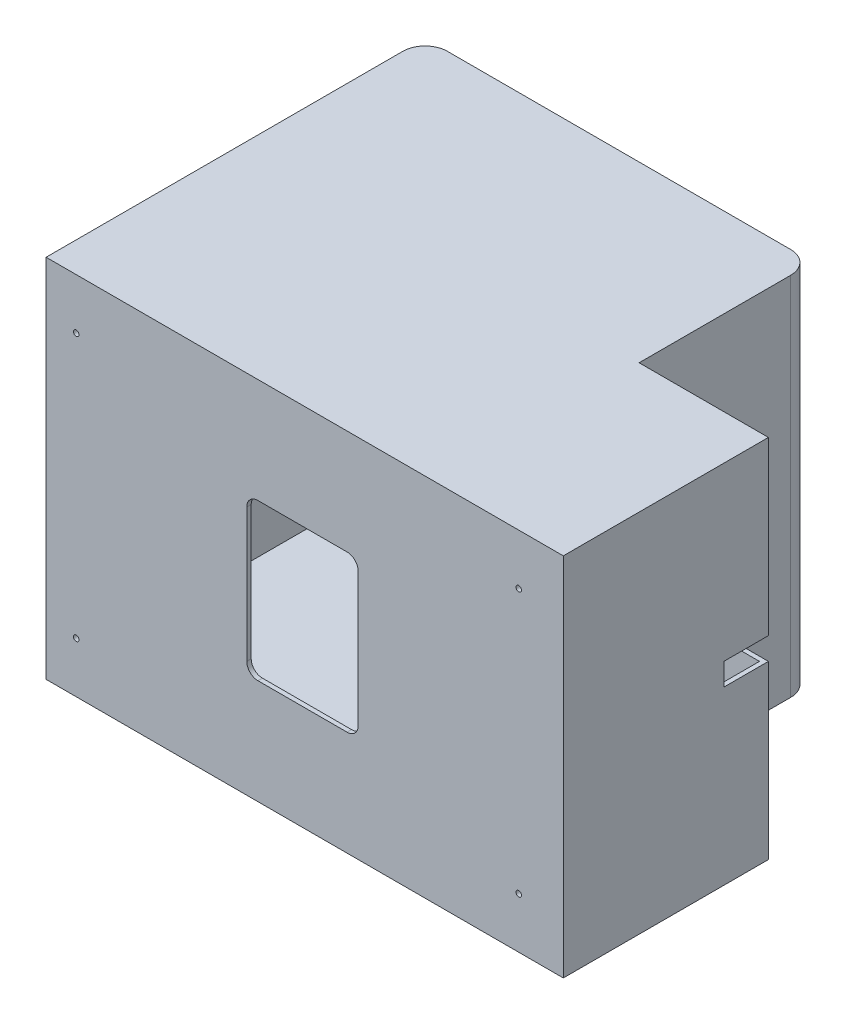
ISO-10303-21;
HEADER;
FILE_DESCRIPTION(('STEP AP214'),'2;1');
FILE_NAME('part.step','',(''),(''),'','','');
FILE_SCHEMA(('AUTOMOTIVE_DESIGN { 1 0 10303 214 1 1 1 1 }'));
ENDSEC;
DATA;
#1=APPLICATION_CONTEXT('core data for automotive mechanical design processes');
#2=APPLICATION_PROTOCOL_DEFINITION('international standard','automotive_design',2000,#1);
#3=PRODUCT_CONTEXT('',#1,'mechanical');
#4=PRODUCT('Part','Part','',(#3));
#5=PRODUCT_RELATED_PRODUCT_CATEGORY('part','',(#4));
#6=PRODUCT_DEFINITION_FORMATION('','',#4);
#7=PRODUCT_DEFINITION_CONTEXT('part definition',#1,'design');
#8=PRODUCT_DEFINITION('design','',#6,#7);
#9=PRODUCT_DEFINITION_SHAPE('','',#8);
#10=(LENGTH_UNIT() NAMED_UNIT(*) SI_UNIT(.MILLI.,.METRE.));
#11=(NAMED_UNIT(*) PLANE_ANGLE_UNIT() SI_UNIT($,.RADIAN.));
#12=(NAMED_UNIT(*) SI_UNIT($,.STERADIAN.) SOLID_ANGLE_UNIT());
#13=UNCERTAINTY_MEASURE_WITH_UNIT(LENGTH_MEASURE(1.E-05),#10,'distance_accuracy_value','');
#14=(GEOMETRIC_REPRESENTATION_CONTEXT(3) GLOBAL_UNCERTAINTY_ASSIGNED_CONTEXT((#13)) GLOBAL_UNIT_ASSIGNED_CONTEXT((#10,
#11,#12)) REPRESENTATION_CONTEXT('',''));
#15=CARTESIAN_POINT('',(0.,0.,0.));
#16=DIRECTION('',(0.,0.,1.));
#17=DIRECTION('',(1.,0.,0.));
#18=AXIS2_PLACEMENT_3D('',#15,#16,#17);
#19=CARTESIAN_POINT('',(189.603938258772,164.,-77.9102908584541));
#20=DIRECTION('',(0.,0.,1.));
#21=DIRECTION('',(1.,0.,0.));
#22=AXIS2_PLACEMENT_3D('',#19,#20,#21);
#23=PLANE('',#22);
#24=DIRECTION('',(0.,-1.,0.));
#25=VECTOR('',#24,1.);
#26=CARTESIAN_POINT('',(131.603938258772,164.,-77.9102908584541));
#27=LINE('',#26,#25);
#28=CARTESIAN_POINT('',(131.603938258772,77.,-77.9102908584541));
#29=VERTEX_POINT('',#28);
#30=CARTESIAN_POINT('',(131.603938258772,0.,-77.9102908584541));
#31=VERTEX_POINT('',#30);
#32=EDGE_CURVE('E422',#29,#31,#27,.T.);
#33=ORIENTED_EDGE('',*,*,#32,.F.);
#34=DIRECTION('',(1.,0.,0.));
#35=VECTOR('',#34,1.);
#36=CARTESIAN_POINT('',(96.6039382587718,77.,-77.9102908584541));
#37=LINE('',#36,#35);
#38=CARTESIAN_POINT('',(189.603938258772,77.,-77.9102908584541));
#39=VERTEX_POINT('',#38);
#40=EDGE_CURVE('E468',#29,#39,#37,.T.);
#41=ORIENTED_EDGE('',*,*,#40,.T.);
#42=DIRECTION('',(0.,-1.,0.));
#43=VECTOR('',#42,1.);
#44=CARTESIAN_POINT('',(189.603938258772,164.,-77.9102908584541));
#45=LINE('',#44,#43);
#46=CARTESIAN_POINT('',(189.603938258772,0.,-77.9102908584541));
#47=VERTEX_POINT('',#46);
#48=EDGE_CURVE('E271',#39,#47,#45,.T.);
#49=ORIENTED_EDGE('',*,*,#48,.T.);
#50=DIRECTION('',(-1.,0.,0.));
#51=VECTOR('',#50,1.);
#52=CARTESIAN_POINT('',(189.603938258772,0.,-77.9102908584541));
#53=LINE('',#52,#51);
#54=EDGE_CURVE('E431',#47,#31,#53,.T.);
#55=ORIENTED_EDGE('',*,*,#54,.T.);
#56=EDGE_LOOP('',(#33,#41,#49,#55));
#57=FACE_BOUND('',#56,.T.);
#58=ADVANCED_FACE('F16',(#57),#23,.F.);
#59=CARTESIAN_POINT('',(189.603938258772,164.,-75.9102908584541));
#60=DIRECTION('',(0.,0.,1.));
#61=DIRECTION('',(1.,0.,0.));
#62=AXIS2_PLACEMENT_3D('',#59,#60,#61);
#63=PLANE('',#62);
#64=DIRECTION('',(1.,0.,0.));
#65=VECTOR('',#64,1.);
#66=CARTESIAN_POINT('',(189.603938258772,77.,-75.9102908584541));
#67=LINE('',#66,#65);
#68=CARTESIAN_POINT('',(129.603938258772,77.,-75.9102908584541));
#69=VERTEX_POINT('',#68);
#70=CARTESIAN_POINT('',(187.603938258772,77.,-75.9102908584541));
#71=VERTEX_POINT('',#70);
#72=EDGE_CURVE('E25',#69,#71,#67,.T.);
#73=ORIENTED_EDGE('',*,*,#72,.F.);
#74=DIRECTION('',(0.,-1.,0.));
#75=VECTOR('',#74,1.);
#76=CARTESIAN_POINT('',(129.603938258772,164.,-75.9102908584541));
#77=LINE('',#76,#75);
#78=CARTESIAN_POINT('',(129.603938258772,2.,-75.9102908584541));
#79=VERTEX_POINT('',#78);
#80=EDGE_CURVE('E385',#69,#79,#77,.T.);
#81=ORIENTED_EDGE('',*,*,#80,.T.);
#82=DIRECTION('',(-1.,0.,0.));
#83=VECTOR('',#82,1.);
#84=CARTESIAN_POINT('',(0.,2.,-75.9102908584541));
#85=LINE('',#84,#83);
#86=CARTESIAN_POINT('',(187.603938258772,2.,-75.9102908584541));
#87=VERTEX_POINT('',#86);
#88=EDGE_CURVE('E378',#87,#79,#85,.T.);
#89=ORIENTED_EDGE('',*,*,#88,.F.);
#90=DIRECTION('',(0.,-1.,0.));
#91=VECTOR('',#90,1.);
#92=CARTESIAN_POINT('',(187.603938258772,164.,-75.9102908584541));
#93=LINE('',#92,#91);
#94=EDGE_CURVE('E371',#71,#87,#93,.T.);
#95=ORIENTED_EDGE('',*,*,#94,.F.);
#96=EDGE_LOOP('',(#73,#81,#89,#95));
#97=FACE_BOUND('',#96,.T.);
#98=ADVANCED_FACE('F376',(#97),#63,.T.);
#99=CARTESIAN_POINT('',(129.603938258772,164.,-155.910290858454));
#100=DIRECTION('',(-1.,0.,0.));
#101=DIRECTION('',(0.,0.,1.));
#102=AXIS2_PLACEMENT_3D('',#99,#100,#101);
#103=PLANE('',#102);
#104=DIRECTION('',(0.,0.,1.));
#105=VECTOR('',#104,1.);
#106=CARTESIAN_POINT('',(129.603938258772,77.,-155.910290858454));
#107=LINE('',#106,#105);
#108=CARTESIAN_POINT('',(129.603938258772,77.,-77.9102908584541));
#109=VERTEX_POINT('',#108);
#110=EDGE_CURVE('E363',#109,#69,#107,.T.);
#111=ORIENTED_EDGE('',*,*,#110,.F.);
#112=DIRECTION('',(0.,-1.,0.));
#113=VECTOR('',#112,1.);
#114=CARTESIAN_POINT('',(129.603938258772,164.,-77.9102908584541));
#115=LINE('',#114,#113);
#116=CARTESIAN_POINT('',(129.603938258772,87.,-77.9102908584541));
#117=VERTEX_POINT('',#116);
#118=EDGE_CURVE('E480',#117,#109,#115,.T.);
#119=ORIENTED_EDGE('',*,*,#118,.F.);
#120=DIRECTION('',(0.,0.,-1.));
#121=VECTOR('',#120,1.);
#122=CARTESIAN_POINT('',(129.603938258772,87.,-155.910290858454));
#123=LINE('',#122,#121);
#124=CARTESIAN_POINT('',(129.603938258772,87.,-75.9102908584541));
#125=VERTEX_POINT('',#124);
#126=EDGE_CURVE('E373',#125,#117,#123,.T.);
#127=ORIENTED_EDGE('',*,*,#126,.F.);
#128=CARTESIAN_POINT('',(129.603938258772,162.,-75.9102908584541));
#129=VERTEX_POINT('',#128);
#130=EDGE_CURVE('E380',#129,#125,#77,.T.);
#131=ORIENTED_EDGE('',*,*,#130,.F.);
#132=DIRECTION('',(0.,0.,-1.));
#133=VECTOR('',#132,1.);
#134=CARTESIAN_POINT('',(129.603938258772,162.,0.));
#135=LINE('',#134,#133);
#136=CARTESIAN_POINT('',(129.603938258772,162.,-143.910290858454));
#137=VERTEX_POINT('',#136);
#138=EDGE_CURVE('E398',#129,#137,#135,.T.);
#139=ORIENTED_EDGE('',*,*,#138,.T.);
#140=DIRECTION('',(0.,-1.,0.));
#141=VECTOR('',#140,1.);
#142=CARTESIAN_POINT('',(129.603938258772,164.,-143.910290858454));
#143=LINE('',#142,#141);
#144=CARTESIAN_POINT('',(129.603938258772,2.,-143.910290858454));
#145=VERTEX_POINT('',#144);
#146=EDGE_CURVE('E349',#137,#145,#143,.T.);
#147=ORIENTED_EDGE('',*,*,#146,.T.);
#148=DIRECTION('',(0.,0.,-1.));
#149=VECTOR('',#148,1.);
#150=CARTESIAN_POINT('',(129.603938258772,2.,0.));
#151=LINE('',#150,#149);
#152=EDGE_CURVE('E395',#79,#145,#151,.T.);
#153=ORIENTED_EDGE('',*,*,#152,.F.);
#154=ORIENTED_EDGE('',*,*,#80,.F.);
#155=EDGE_LOOP('',(#111,#119,#127,#131,#139,#147,#153,#154));
#156=FACE_BOUND('',#155,.T.);
#157=ADVANCED_FACE('F566',(#156),#103,.T.);
#158=CARTESIAN_POINT('',(-42.3960617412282,164.,-155.910290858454));
#159=DIRECTION('',(0.,0.,1.));
#160=DIRECTION('',(1.,0.,0.));
#161=AXIS2_PLACEMENT_3D('',#158,#159,#160);
#162=PLANE('',#161);
#163=DIRECTION('',(0.,1.,0.));
#164=VECTOR('',#163,1.);
#165=CARTESIAN_POINT('',(101.603938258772,162.,-155.910290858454));
#166=LINE('',#165,#164);
#167=CARTESIAN_POINT('',(101.603938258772,2.,-155.910290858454));
#168=VERTEX_POINT('',#167);
#169=CARTESIAN_POINT('',(101.603938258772,162.,-155.910290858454));
#170=VERTEX_POINT('',#169);
#171=EDGE_CURVE('E482',#168,#170,#166,.T.);
#172=ORIENTED_EDGE('',*,*,#171,.T.);
#173=DIRECTION('',(-1.,0.,0.));
#174=VECTOR('',#173,1.);
#175=CARTESIAN_POINT('',(0.,162.,-155.910290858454));
#176=LINE('',#175,#174);
#177=CARTESIAN_POINT('',(2.10393825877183,162.,-155.910290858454));
#178=VERTEX_POINT('',#177);
#179=EDGE_CURVE('E404',#170,#178,#176,.T.);
#180=ORIENTED_EDGE('',*,*,#179,.T.);
#181=DIRECTION('',(0.,-1.,0.));
#182=VECTOR('',#181,1.);
#183=CARTESIAN_POINT('',(2.10393825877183,162.,-155.910290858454));
#184=LINE('',#183,#182);
#185=CARTESIAN_POINT('',(2.10393825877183,2.,-155.910290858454));
#186=VERTEX_POINT('',#185);
#187=EDGE_CURVE('E497',#178,#186,#184,.T.);
#188=ORIENTED_EDGE('',*,*,#187,.T.);
#189=DIRECTION('',(-1.,0.,0.));
#190=VECTOR('',#189,1.);
#191=CARTESIAN_POINT('',(0.,2.,-155.910290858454));
#192=LINE('',#191,#190);
#193=EDGE_CURVE('E401',#168,#186,#192,.T.);
#194=ORIENTED_EDGE('',*,*,#193,.F.);
#195=EDGE_LOOP('',(#172,#180,#188,#194));
#196=FACE_BOUND('',#195,.T.);
#197=DIRECTION('',(-1.,0.,0.));
#198=VECTOR('',#197,1.);
#199=CARTESIAN_POINT('',(-42.3960617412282,0.,-155.910290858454));
#200=LINE('',#199,#198);
#201=CARTESIAN_POINT('',(121.603938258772,0.,-155.910290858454));
#202=VERTEX_POINT('',#201);
#203=CARTESIAN_POINT('',(-32.3960617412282,0.,-155.910290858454));
#204=VERTEX_POINT('',#203);
#205=EDGE_CURVE('E411',#202,#204,#200,.T.);
#206=ORIENTED_EDGE('',*,*,#205,.T.);
#207=DIRECTION('',(0.,-1.,0.));
#208=VECTOR('',#207,1.);
#209=CARTESIAN_POINT('',(-32.3960617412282,164.,-155.910290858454));
#210=LINE('',#209,#208);
#211=CARTESIAN_POINT('',(-32.3960617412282,164.,-155.910290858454));
#212=VERTEX_POINT('',#211);
#213=EDGE_CURVE('E328',#204,#212,#210,.F.);
#214=ORIENTED_EDGE('',*,*,#213,.T.);
#215=DIRECTION('',(-1.,0.,0.));
#216=VECTOR('',#215,1.);
#217=CARTESIAN_POINT('',(-42.3960617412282,164.,-155.910290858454));
#218=LINE('',#217,#216);
#219=CARTESIAN_POINT('',(121.603938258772,164.,-155.910290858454));
#220=VERTEX_POINT('',#219);
#221=EDGE_CURVE('E419',#220,#212,#218,.T.);
#222=ORIENTED_EDGE('',*,*,#221,.F.);
#223=DIRECTION('',(0.,-1.,0.));
#224=VECTOR('',#223,1.);
#225=CARTESIAN_POINT('',(121.603938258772,164.,-155.910290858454));
#226=LINE('',#225,#224);
#227=EDGE_CURVE('E325',#220,#202,#226,.T.);
#228=ORIENTED_EDGE('',*,*,#227,.T.);
#229=EDGE_LOOP('',(#206,#214,#222,#228));
#230=FACE_BOUND('',#229,.T.);
#231=ADVANCED_FACE('F440',(#196,#230),#162,.F.);
#232=CARTESIAN_POINT('',(-42.3960617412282,164.,14.0897091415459));
#233=DIRECTION('',(1.,0.,0.));
#234=DIRECTION('',(0.,0.,-1.));
#235=AXIS2_PLACEMENT_3D('',#232,#233,#234);
#236=PLANE('',#235);
#237=DIRECTION('',(0.,0.,1.));
#238=VECTOR('',#237,1.);
#239=CARTESIAN_POINT('',(-42.3960617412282,164.,14.0897091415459));
#240=LINE('',#239,#238);
#241=CARTESIAN_POINT('',(-42.3960617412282,164.,-145.910290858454));
#242=VERTEX_POINT('',#241);
#243=CARTESIAN_POINT('',(-42.3960617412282,164.,14.0897091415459));
#244=VERTEX_POINT('',#243);
#245=EDGE_CURVE('E408',#242,#244,#240,.T.);
#246=ORIENTED_EDGE('',*,*,#245,.F.);
#247=DIRECTION('',(0.,-1.,0.));
#248=VECTOR('',#247,1.);
#249=CARTESIAN_POINT('',(-42.3960617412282,164.,-145.910290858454));
#250=LINE('',#249,#248);
#251=CARTESIAN_POINT('',(-42.3960617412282,0.,-145.910290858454));
#252=VERTEX_POINT('',#251);
#253=EDGE_CURVE('E318',#242,#252,#250,.T.);
#254=ORIENTED_EDGE('',*,*,#253,.T.);
#255=DIRECTION('',(0.,0.,1.));
#256=VECTOR('',#255,1.);
#257=CARTESIAN_POINT('',(-42.3960617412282,0.,14.0897091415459));
#258=LINE('',#257,#256);
#259=CARTESIAN_POINT('',(-42.3960617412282,0.,14.0897091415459));
#260=VERTEX_POINT('',#259);
#261=EDGE_CURVE('E423',#252,#260,#258,.T.);
#262=ORIENTED_EDGE('',*,*,#261,.T.);
#263=DIRECTION('',(0.,-1.,0.));
#264=VECTOR('',#263,1.);
#265=CARTESIAN_POINT('',(-42.3960617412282,164.,14.0897091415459));
#266=LINE('',#265,#264);
#267=EDGE_CURVE('E274',#244,#260,#266,.T.);
#268=ORIENTED_EDGE('',*,*,#267,.F.);
#269=EDGE_LOOP('',(#246,#254,#262,#268));
#270=FACE_BOUND('',#269,.T.);
#271=ADVANCED_FACE('F454',(#270),#236,.F.);
#272=CARTESIAN_POINT('',(-42.3960617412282,164.,14.0897091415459));
#273=DIRECTION('',(0.,0.,-1.));
#274=DIRECTION('',(-1.,0.,0.));
#275=AXIS2_PLACEMENT_3D('',#272,#273,#274);
#276=PLANE('',#275);
#277=CARTESIAN_POINT('',(-28.8960617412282,141.25,14.0897091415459));
#278=DIRECTION('',(0.,0.,1.));
#279=DIRECTION('',(1.,0.,0.));
#280=AXIS2_PLACEMENT_3D('',#277,#278,#279);
#281=CIRCLE('',#280,1.25);
#282=CARTESIAN_POINT('',(-27.6460617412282,141.25,14.0897091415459));
#283=VERTEX_POINT('',#282);
#284=EDGE_CURVE('E772',#283,#283,#281,.T.);
#285=ORIENTED_EDGE('',*,*,#284,.F.);
#286=EDGE_LOOP('',(#285));
#287=FACE_BOUND('',#286,.T.);
#288=CARTESIAN_POINT('',(-28.8960617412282,22.75,14.0897091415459));
#289=DIRECTION('',(0.,0.,1.));
#290=DIRECTION('',(1.,0.,0.));
#291=AXIS2_PLACEMENT_3D('',#288,#289,#290);
#292=CIRCLE('',#291,1.25);
#293=CARTESIAN_POINT('',(-27.6460617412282,22.75,14.0897091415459));
#294=VERTEX_POINT('',#293);
#295=EDGE_CURVE('E774',#294,#294,#292,.T.);
#296=ORIENTED_EDGE('',*,*,#295,.F.);
#297=EDGE_LOOP('',(#296));
#298=FACE_BOUND('',#297,.T.);
#299=CARTESIAN_POINT('',(169.603938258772,141.25,14.0897091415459));
#300=DIRECTION('',(0.,0.,1.));
#301=DIRECTION('',(1.,0.,0.));
#302=AXIS2_PLACEMENT_3D('',#299,#300,#301);
#303=CIRCLE('',#302,1.25);
#304=CARTESIAN_POINT('',(170.853938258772,141.25,14.0897091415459));
#305=VERTEX_POINT('',#304);
#306=EDGE_CURVE('E782',#305,#305,#303,.T.);
#307=ORIENTED_EDGE('',*,*,#306,.F.);
#308=EDGE_LOOP('',(#307));
#309=FACE_BOUND('',#308,.T.);
#310=CARTESIAN_POINT('',(169.603938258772,22.75,14.0897091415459));
#311=DIRECTION('',(0.,0.,1.));
#312=DIRECTION('',(1.,0.,0.));
#313=AXIS2_PLACEMENT_3D('',#310,#311,#312);
#314=CIRCLE('',#313,1.25);
#315=CARTESIAN_POINT('',(170.853938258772,22.75,14.0897091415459));
#316=VERTEX_POINT('',#315);
#317=EDGE_CURVE('E788',#316,#316,#314,.T.);
#318=ORIENTED_EDGE('',*,*,#317,.F.);
#319=EDGE_LOOP('',(#318));
#320=FACE_BOUND('',#319,.T.);
#321=DIRECTION('',(1.,0.,0.));
#322=VECTOR('',#321,1.);
#323=CARTESIAN_POINT('',(47.6039382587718,47.,14.0897091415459));
#324=LINE('',#323,#322);
#325=CARTESIAN_POINT('',(52.6039382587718,47.,14.0897091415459));
#326=VERTEX_POINT('',#325);
#327=CARTESIAN_POINT('',(92.6039382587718,47.,14.0897091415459));
#328=VERTEX_POINT('',#327);
#329=EDGE_CURVE('E533',#326,#328,#324,.T.);
#330=ORIENTED_EDGE('',*,*,#329,.F.);
#331=CARTESIAN_POINT('',(52.6039382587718,52.,14.0897091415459));
#332=DIRECTION('',(0.,0.,-1.));
#333=DIRECTION('',(-1.,0.,0.));
#334=AXIS2_PLACEMENT_3D('',#331,#332,#333);
#335=CIRCLE('',#334,5.);
#336=CARTESIAN_POINT('',(47.6039382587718,52.,14.0897091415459));
#337=VERTEX_POINT('',#336);
#338=EDGE_CURVE('E302',#326,#337,#335,.T.);
#339=ORIENTED_EDGE('',*,*,#338,.T.);
#340=DIRECTION('',(0.,-1.,0.));
#341=VECTOR('',#340,1.);
#342=CARTESIAN_POINT('',(47.6039382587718,117.,14.0897091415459));
#343=LINE('',#342,#341);
#344=CARTESIAN_POINT('',(47.6039382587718,112.,14.0897091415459));
#345=VERTEX_POINT('',#344);
#346=EDGE_CURVE('E514',#345,#337,#343,.T.);
#347=ORIENTED_EDGE('',*,*,#346,.F.);
#348=CARTESIAN_POINT('',(52.6039382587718,112.,14.0897091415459));
#349=DIRECTION('',(0.,0.,-1.));
#350=DIRECTION('',(-1.,0.,0.));
#351=AXIS2_PLACEMENT_3D('',#348,#349,#350);
#352=CIRCLE('',#351,5.);
#353=CARTESIAN_POINT('',(52.6039382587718,117.,14.0897091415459));
#354=VERTEX_POINT('',#353);
#355=EDGE_CURVE('E314',#345,#354,#352,.T.);
#356=ORIENTED_EDGE('',*,*,#355,.T.);
#357=DIRECTION('',(-1.,0.,0.));
#358=VECTOR('',#357,1.);
#359=CARTESIAN_POINT('',(47.6039382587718,117.,14.0897091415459));
#360=LINE('',#359,#358);
#361=CARTESIAN_POINT('',(92.6039382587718,117.,14.0897091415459));
#362=VERTEX_POINT('',#361);
#363=EDGE_CURVE('E521',#362,#354,#360,.T.);
#364=ORIENTED_EDGE('',*,*,#363,.F.);
#365=CARTESIAN_POINT('',(92.6039382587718,112.,14.0897091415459));
#366=DIRECTION('',(0.,0.,-1.));
#367=DIRECTION('',(-1.,0.,0.));
#368=AXIS2_PLACEMENT_3D('',#365,#366,#367);
#369=CIRCLE('',#368,5.);
#370=CARTESIAN_POINT('',(97.6039382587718,112.,14.0897091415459));
#371=VERTEX_POINT('',#370);
#372=EDGE_CURVE('E310',#362,#371,#369,.T.);
#373=ORIENTED_EDGE('',*,*,#372,.T.);
#374=DIRECTION('',(0.,1.,0.));
#375=VECTOR('',#374,1.);
#376=CARTESIAN_POINT('',(97.6039382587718,117.,14.0897091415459));
#377=LINE('',#376,#375);
#378=CARTESIAN_POINT('',(97.6039382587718,52.,14.0897091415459));
#379=VERTEX_POINT('',#378);
#380=EDGE_CURVE('E536',#379,#371,#377,.T.);
#381=ORIENTED_EDGE('',*,*,#380,.F.);
#382=CARTESIAN_POINT('',(92.6039382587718,52.,14.0897091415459));
#383=DIRECTION('',(0.,0.,-1.));
#384=DIRECTION('',(-1.,0.,0.));
#385=AXIS2_PLACEMENT_3D('',#382,#383,#384);
#386=CIRCLE('',#385,5.);
#387=EDGE_CURVE('E306',#379,#328,#386,.T.);
#388=ORIENTED_EDGE('',*,*,#387,.T.);
#389=EDGE_LOOP('',(#330,#339,#347,#356,#364,#373,#381,#388));
#390=FACE_BOUND('',#389,.T.);
#391=DIRECTION('',(1.,0.,0.));
#392=VECTOR('',#391,1.);
#393=CARTESIAN_POINT('',(-42.3960617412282,0.,14.0897091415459));
#394=LINE('',#393,#392);
#395=CARTESIAN_POINT('',(189.603938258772,0.,14.0897091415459));
#396=VERTEX_POINT('',#395);
#397=EDGE_CURVE('E425',#260,#396,#394,.T.);
#398=ORIENTED_EDGE('',*,*,#397,.T.);
#399=DIRECTION('',(0.,-1.,0.));
#400=VECTOR('',#399,1.);
#401=CARTESIAN_POINT('',(189.603938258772,164.,14.0897091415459));
#402=LINE('',#401,#400);
#403=CARTESIAN_POINT('',(189.603938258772,164.,14.0897091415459));
#404=VERTEX_POINT('',#403);
#405=EDGE_CURVE('E270',#404,#396,#402,.T.);
#406=ORIENTED_EDGE('',*,*,#405,.F.);
#407=DIRECTION('',(1.,0.,0.));
#408=VECTOR('',#407,1.);
#409=CARTESIAN_POINT('',(-42.3960617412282,164.,14.0897091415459));
#410=LINE('',#409,#408);
#411=EDGE_CURVE('E410',#244,#404,#410,.T.);
#412=ORIENTED_EDGE('',*,*,#411,.F.);
#413=ORIENTED_EDGE('',*,*,#267,.T.);
#414=EDGE_LOOP('',(#398,#406,#412,#413));
#415=FACE_BOUND('',#414,.T.);
#416=ADVANCED_FACE('F458',(#287,#298,#309,#320,#390,#415),#276,.F.);
#417=CARTESIAN_POINT('',(189.603938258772,164.,14.0897091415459));
#418=DIRECTION('',(-1.,0.,0.));
#419=DIRECTION('',(0.,0.,1.));
#420=AXIS2_PLACEMENT_3D('',#417,#418,#419);
#421=PLANE('',#420);
#422=ORIENTED_EDGE('',*,*,#48,.F.);
#423=DIRECTION('',(0.,0.,-1.));
#424=VECTOR('',#423,1.);
#425=CARTESIAN_POINT('',(189.603938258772,77.,-77.9102908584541));
#426=LINE('',#425,#424);
#427=CARTESIAN_POINT('',(189.603938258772,77.,-57.9102908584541));
#428=VERTEX_POINT('',#427);
#429=EDGE_CURVE('E255',#428,#39,#426,.T.);
#430=ORIENTED_EDGE('',*,*,#429,.F.);
#431=DIRECTION('',(0.,-1.,0.));
#432=VECTOR('',#431,1.);
#433=CARTESIAN_POINT('',(189.603938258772,87.,-57.9102908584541));
#434=LINE('',#433,#432);
#435=CARTESIAN_POINT('',(189.603938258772,87.,-57.9102908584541));
#436=VERTEX_POINT('',#435);
#437=EDGE_CURVE('E266',#436,#428,#434,.T.);
#438=ORIENTED_EDGE('',*,*,#437,.F.);
#439=DIRECTION('',(0.,0.,1.));
#440=VECTOR('',#439,1.);
#441=CARTESIAN_POINT('',(189.603938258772,87.,-77.9102908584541));
#442=LINE('',#441,#440);
#443=CARTESIAN_POINT('',(189.603938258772,87.,-77.9102908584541));
#444=VERTEX_POINT('',#443);
#445=EDGE_CURVE('E247',#444,#436,#442,.T.);
#446=ORIENTED_EDGE('',*,*,#445,.F.);
#447=CARTESIAN_POINT('',(189.603938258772,164.,-77.9102908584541));
#448=VERTEX_POINT('',#447);
#449=EDGE_CURVE('E262',#448,#444,#45,.T.);
#450=ORIENTED_EDGE('',*,*,#449,.F.);
#451=DIRECTION('',(0.,0.,-1.));
#452=VECTOR('',#451,1.);
#453=CARTESIAN_POINT('',(189.603938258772,164.,14.0897091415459));
#454=LINE('',#453,#452);
#455=EDGE_CURVE('E413',#404,#448,#454,.T.);
#456=ORIENTED_EDGE('',*,*,#455,.F.);
#457=ORIENTED_EDGE('',*,*,#405,.T.);
#458=DIRECTION('',(0.,0.,-1.));
#459=VECTOR('',#458,1.);
#460=CARTESIAN_POINT('',(189.603938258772,0.,14.0897091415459));
#461=LINE('',#460,#459);
#462=EDGE_CURVE('E428',#396,#47,#461,.T.);
#463=ORIENTED_EDGE('',*,*,#462,.T.);
#464=EDGE_LOOP('',(#422,#430,#438,#446,#450,#456,#457,#463));
#465=FACE_BOUND('',#464,.T.);
#466=ADVANCED_FACE('F260',(#465),#421,.F.);
#467=ORIENTED_EDGE('',*,*,#449,.T.);
#468=DIRECTION('',(1.,0.,0.));
#469=VECTOR('',#468,1.);
#470=CARTESIAN_POINT('',(96.6039382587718,87.,-77.9102908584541));
#471=LINE('',#470,#469);
#472=CARTESIAN_POINT('',(131.603938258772,87.,-77.9102908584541));
#473=VERTEX_POINT('',#472);
#474=EDGE_CURVE('E244',#473,#444,#471,.T.);
#475=ORIENTED_EDGE('',*,*,#474,.F.);
#476=CARTESIAN_POINT('',(131.603938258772,164.,-77.9102908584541));
#477=VERTEX_POINT('',#476);
#478=EDGE_CURVE('E276',#477,#473,#27,.T.);
#479=ORIENTED_EDGE('',*,*,#478,.F.);
#480=DIRECTION('',(-1.,0.,0.));
#481=VECTOR('',#480,1.);
#482=CARTESIAN_POINT('',(189.603938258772,164.,-77.9102908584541));
#483=LINE('',#482,#481);
#484=EDGE_CURVE('E269',#448,#477,#483,.T.);
#485=ORIENTED_EDGE('',*,*,#484,.F.);
#486=EDGE_LOOP('',(#467,#475,#479,#485));
#487=FACE_BOUND('',#486,.T.);
#488=ADVANCED_FACE('F268',(#487),#23,.F.);
#489=CARTESIAN_POINT('',(131.603938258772,164.,-155.910290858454));
#490=DIRECTION('',(-1.,0.,0.));
#491=DIRECTION('',(0.,0.,1.));
#492=AXIS2_PLACEMENT_3D('',#489,#490,#491);
#493=PLANE('',#492);
#494=DIRECTION('',(0.,0.,-1.));
#495=VECTOR('',#494,1.);
#496=CARTESIAN_POINT('',(131.603938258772,0.,-155.910290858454));
#497=LINE('',#496,#495);
#498=CARTESIAN_POINT('',(131.603938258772,0.,-145.910290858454));
#499=VERTEX_POINT('',#498);
#500=EDGE_CURVE('E434',#31,#499,#497,.T.);
#501=ORIENTED_EDGE('',*,*,#500,.T.);
#502=DIRECTION('',(0.,-1.,0.));
#503=VECTOR('',#502,1.);
#504=CARTESIAN_POINT('',(131.603938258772,164.,-145.910290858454));
#505=LINE('',#504,#503);
#506=CARTESIAN_POINT('',(131.603938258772,164.,-145.910290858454));
#507=VERTEX_POINT('',#506);
#508=EDGE_CURVE('E334',#499,#507,#505,.F.);
#509=ORIENTED_EDGE('',*,*,#508,.T.);
#510=DIRECTION('',(0.,0.,-1.));
#511=VECTOR('',#510,1.);
#512=CARTESIAN_POINT('',(131.603938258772,164.,-155.910290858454));
#513=LINE('',#512,#511);
#514=EDGE_CURVE('E416',#477,#507,#513,.T.);
#515=ORIENTED_EDGE('',*,*,#514,.F.);
#516=ORIENTED_EDGE('',*,*,#478,.T.);
#517=EDGE_CURVE('E570',#473,#29,#27,.T.);
#518=ORIENTED_EDGE('',*,*,#517,.T.);
#519=ORIENTED_EDGE('',*,*,#32,.T.);
#520=EDGE_LOOP('',(#501,#509,#515,#516,#518,#519));
#521=FACE_BOUND('',#520,.T.);
#522=ADVANCED_FACE('F572',(#521),#493,.F.);
#523=CARTESIAN_POINT('',(0.,164.,0.));
#524=DIRECTION('',(0.,-1.,0.));
#525=DIRECTION('',(0.,0.,-1.));
#526=AXIS2_PLACEMENT_3D('',#523,#524,#525);
#527=PLANE('',#526);
#528=ORIENTED_EDGE('',*,*,#221,.T.);
#529=CARTESIAN_POINT('',(-32.3960617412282,164.,-145.910290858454));
#530=DIRECTION('',(0.,-1.,0.));
#531=DIRECTION('',(0.,0.,-1.));
#532=AXIS2_PLACEMENT_3D('',#529,#530,#531);
#533=CIRCLE('',#532,10.);
#534=EDGE_CURVE('E332',#212,#242,#533,.F.);
#535=ORIENTED_EDGE('',*,*,#534,.T.);
#536=ORIENTED_EDGE('',*,*,#245,.T.);
#537=ORIENTED_EDGE('',*,*,#411,.T.);
#538=ORIENTED_EDGE('',*,*,#455,.T.);
#539=ORIENTED_EDGE('',*,*,#484,.T.);
#540=ORIENTED_EDGE('',*,*,#514,.T.);
#541=CARTESIAN_POINT('',(121.603938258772,164.,-145.910290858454));
#542=DIRECTION('',(0.,-1.,0.));
#543=DIRECTION('',(0.,0.,-1.));
#544=AXIS2_PLACEMENT_3D('',#541,#542,#543);
#545=CIRCLE('',#544,10.);
#546=EDGE_CURVE('E330',#507,#220,#545,.F.);
#547=ORIENTED_EDGE('',*,*,#546,.T.);
#548=EDGE_LOOP('',(#528,#535,#536,#537,#538,#539,#540,#547));
#549=FACE_BOUND('',#548,.T.);
#550=ADVANCED_FACE('F450',(#549),#527,.F.);
#551=CARTESIAN_POINT('',(0.,0.,0.));
#552=DIRECTION('',(0.,-1.,0.));
#553=DIRECTION('',(0.,0.,-1.));
#554=AXIS2_PLACEMENT_3D('',#551,#552,#553);
#555=PLANE('',#554);
#556=ORIENTED_EDGE('',*,*,#261,.F.);
#557=CARTESIAN_POINT('',(-32.3960617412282,0.,-145.910290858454));
#558=DIRECTION('',(0.,-1.,0.));
#559=DIRECTION('',(0.,0.,-1.));
#560=AXIS2_PLACEMENT_3D('',#557,#558,#559);
#561=CIRCLE('',#560,10.);
#562=EDGE_CURVE('E323',#252,#204,#561,.T.);
#563=ORIENTED_EDGE('',*,*,#562,.T.);
#564=ORIENTED_EDGE('',*,*,#205,.F.);
#565=CARTESIAN_POINT('',(121.603938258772,0.,-145.910290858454));
#566=DIRECTION('',(0.,-1.,0.));
#567=DIRECTION('',(0.,0.,-1.));
#568=AXIS2_PLACEMENT_3D('',#565,#566,#567);
#569=CIRCLE('',#568,10.);
#570=EDGE_CURVE('E321',#202,#499,#569,.T.);
#571=ORIENTED_EDGE('',*,*,#570,.T.);
#572=ORIENTED_EDGE('',*,*,#500,.F.);
#573=ORIENTED_EDGE('',*,*,#54,.F.);
#574=ORIENTED_EDGE('',*,*,#462,.F.);
#575=ORIENTED_EDGE('',*,*,#397,.F.);
#576=EDGE_LOOP('',(#556,#563,#564,#571,#572,#573,#574,#575));
#577=FACE_BOUND('',#576,.T.);
#578=ADVANCED_FACE('F462',(#577),#555,.T.);
#579=CARTESIAN_POINT('',(-40.3960617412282,164.,14.0897091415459));
#580=DIRECTION('',(1.,0.,0.));
#581=DIRECTION('',(0.,0.,-1.));
#582=AXIS2_PLACEMENT_3D('',#579,#580,#581);
#583=PLANE('',#582);
#584=DIRECTION('',(0.,0.,1.));
#585=VECTOR('',#584,1.);
#586=CARTESIAN_POINT('',(-40.3960617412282,2.,0.));
#587=LINE('',#586,#585);
#588=CARTESIAN_POINT('',(-40.3960617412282,2.,-143.910290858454));
#589=VERTEX_POINT('',#588);
#590=CARTESIAN_POINT('',(-40.3960617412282,2.,12.0897091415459));
#591=VERTEX_POINT('',#590);
#592=EDGE_CURVE('E530',#589,#591,#587,.T.);
#593=ORIENTED_EDGE('',*,*,#592,.F.);
#594=DIRECTION('',(0.,1.,0.));
#595=VECTOR('',#594,1.);
#596=CARTESIAN_POINT('',(-40.3960617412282,162.,-143.910290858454));
#597=LINE('',#596,#595);
#598=CARTESIAN_POINT('',(-40.3960617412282,162.,-143.910290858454));
#599=VERTEX_POINT('',#598);
#600=EDGE_CURVE('E336',#589,#599,#597,.T.);
#601=ORIENTED_EDGE('',*,*,#600,.T.);
#602=DIRECTION('',(0.,0.,1.));
#603=VECTOR('',#602,1.);
#604=CARTESIAN_POINT('',(-40.3960617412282,162.,0.));
#605=LINE('',#604,#603);
#606=CARTESIAN_POINT('',(-40.3960617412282,162.,12.0897091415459));
#607=VERTEX_POINT('',#606);
#608=EDGE_CURVE('E407',#599,#607,#605,.T.);
#609=ORIENTED_EDGE('',*,*,#608,.T.);
#610=DIRECTION('',(0.,-1.,0.));
#611=VECTOR('',#610,1.);
#612=CARTESIAN_POINT('',(-40.3960617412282,164.,12.0897091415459));
#613=LINE('',#612,#611);
#614=EDGE_CURVE('E426',#607,#591,#613,.T.);
#615=ORIENTED_EDGE('',*,*,#614,.T.);
#616=EDGE_LOOP('',(#593,#601,#609,#615));
#617=FACE_BOUND('',#616,.T.);
#618=ADVANCED_FACE('F681',(#617),#583,.T.);
#619=CARTESIAN_POINT('',(-42.3960617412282,164.,12.0897091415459));
#620=DIRECTION('',(0.,0.,-1.));
#621=DIRECTION('',(-1.,0.,0.));
#622=AXIS2_PLACEMENT_3D('',#619,#620,#621);
#623=PLANE('',#622);
#624=CARTESIAN_POINT('',(-28.8960617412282,141.25,12.0897091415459));
#625=DIRECTION('',(0.,0.,-1.));
#626=DIRECTION('',(-1.,0.,0.));
#627=AXIS2_PLACEMENT_3D('',#624,#625,#626);
#628=CIRCLE('',#627,1.25);
#629=CARTESIAN_POINT('',(-30.1460617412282,141.25,12.0897091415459));
#630=VERTEX_POINT('',#629);
#631=EDGE_CURVE('E769',#630,#630,#628,.T.);
#632=ORIENTED_EDGE('',*,*,#631,.F.);
#633=EDGE_LOOP('',(#632));
#634=FACE_BOUND('',#633,.T.);
#635=CARTESIAN_POINT('',(-28.8960617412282,22.75,12.0897091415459));
#636=DIRECTION('',(0.,0.,-1.));
#637=DIRECTION('',(-1.,0.,0.));
#638=AXIS2_PLACEMENT_3D('',#635,#636,#637);
#639=CIRCLE('',#638,1.25);
#640=CARTESIAN_POINT('',(-30.1460617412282,22.75,12.0897091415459));
#641=VERTEX_POINT('',#640);
#642=EDGE_CURVE('E779',#641,#641,#639,.T.);
#643=ORIENTED_EDGE('',*,*,#642,.F.);
#644=EDGE_LOOP('',(#643));
#645=FACE_BOUND('',#644,.T.);
#646=CARTESIAN_POINT('',(169.603938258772,141.25,12.0897091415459));
#647=DIRECTION('',(0.,0.,-1.));
#648=DIRECTION('',(-1.,0.,0.));
#649=AXIS2_PLACEMENT_3D('',#646,#647,#648);
#650=CIRCLE('',#649,1.25);
#651=CARTESIAN_POINT('',(168.353938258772,141.25,12.0897091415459));
#652=VERTEX_POINT('',#651);
#653=EDGE_CURVE('E785',#652,#652,#650,.T.);
#654=ORIENTED_EDGE('',*,*,#653,.F.);
#655=EDGE_LOOP('',(#654));
#656=FACE_BOUND('',#655,.T.);
#657=CARTESIAN_POINT('',(169.603938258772,22.75,12.0897091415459));
#658=DIRECTION('',(0.,0.,-1.));
#659=DIRECTION('',(-1.,0.,0.));
#660=AXIS2_PLACEMENT_3D('',#657,#658,#659);
#661=CIRCLE('',#660,1.25);
#662=CARTESIAN_POINT('',(168.353938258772,22.75,12.0897091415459));
#663=VERTEX_POINT('',#662);
#664=EDGE_CURVE('E20',#663,#663,#661,.T.);
#665=ORIENTED_EDGE('',*,*,#664,.F.);
#666=EDGE_LOOP('',(#665));
#667=FACE_BOUND('',#666,.T.);
#668=DIRECTION('',(-1.,0.,0.));
#669=VECTOR('',#668,1.);
#670=CARTESIAN_POINT('',(47.6039382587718,117.,12.0897091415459));
#671=LINE('',#670,#669);
#672=CARTESIAN_POINT('',(92.6039382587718,117.,12.0897091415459));
#673=VERTEX_POINT('',#672);
#674=CARTESIAN_POINT('',(52.6039382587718,117.,12.0897091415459));
#675=VERTEX_POINT('',#674);
#676=EDGE_CURVE('E527',#673,#675,#671,.T.);
#677=ORIENTED_EDGE('',*,*,#676,.T.);
#678=CARTESIAN_POINT('',(52.6039382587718,112.,12.0897091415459));
#679=DIRECTION('',(0.,0.,-1.));
#680=DIRECTION('',(-1.,0.,0.));
#681=AXIS2_PLACEMENT_3D('',#678,#679,#680);
#682=CIRCLE('',#681,5.);
#683=CARTESIAN_POINT('',(47.6039382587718,112.,12.0897091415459));
#684=VERTEX_POINT('',#683);
#685=EDGE_CURVE('E316',#675,#684,#682,.F.);
#686=ORIENTED_EDGE('',*,*,#685,.T.);
#687=DIRECTION('',(0.,-1.,0.));
#688=VECTOR('',#687,1.);
#689=CARTESIAN_POINT('',(47.6039382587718,117.,12.0897091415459));
#690=LINE('',#689,#688);
#691=CARTESIAN_POINT('',(47.6039382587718,52.,12.0897091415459));
#692=VERTEX_POINT('',#691);
#693=EDGE_CURVE('E517',#684,#692,#690,.T.);
#694=ORIENTED_EDGE('',*,*,#693,.T.);
#695=CARTESIAN_POINT('',(52.6039382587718,52.,12.0897091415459));
#696=DIRECTION('',(0.,0.,-1.));
#697=DIRECTION('',(-1.,0.,0.));
#698=AXIS2_PLACEMENT_3D('',#695,#696,#697);
#699=CIRCLE('',#698,5.);
#700=CARTESIAN_POINT('',(52.6039382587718,47.,12.0897091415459));
#701=VERTEX_POINT('',#700);
#702=EDGE_CURVE('E304',#692,#701,#699,.F.);
#703=ORIENTED_EDGE('',*,*,#702,.T.);
#704=DIRECTION('',(1.,0.,0.));
#705=VECTOR('',#704,1.);
#706=CARTESIAN_POINT('',(47.6039382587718,47.,12.0897091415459));
#707=LINE('',#706,#705);
#708=CARTESIAN_POINT('',(92.6039382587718,47.,12.0897091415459));
#709=VERTEX_POINT('',#708);
#710=EDGE_CURVE('E520',#701,#709,#707,.T.);
#711=ORIENTED_EDGE('',*,*,#710,.T.);
#712=CARTESIAN_POINT('',(92.6039382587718,52.,12.0897091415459));
#713=DIRECTION('',(0.,0.,-1.));
#714=DIRECTION('',(-1.,0.,0.));
#715=AXIS2_PLACEMENT_3D('',#712,#713,#714);
#716=CIRCLE('',#715,5.);
#717=CARTESIAN_POINT('',(97.6039382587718,52.,12.0897091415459));
#718=VERTEX_POINT('',#717);
#719=EDGE_CURVE('E308',#709,#718,#716,.F.);
#720=ORIENTED_EDGE('',*,*,#719,.T.);
#721=DIRECTION('',(0.,1.,0.));
#722=VECTOR('',#721,1.);
#723=CARTESIAN_POINT('',(97.6039382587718,117.,12.0897091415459));
#724=LINE('',#723,#722);
#725=CARTESIAN_POINT('',(97.6039382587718,112.,12.0897091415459));
#726=VERTEX_POINT('',#725);
#727=EDGE_CURVE('E524',#718,#726,#724,.T.);
#728=ORIENTED_EDGE('',*,*,#727,.T.);
#729=CARTESIAN_POINT('',(92.6039382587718,112.,12.0897091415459));
#730=DIRECTION('',(0.,0.,-1.));
#731=DIRECTION('',(-1.,0.,0.));
#732=AXIS2_PLACEMENT_3D('',#729,#730,#731);
#733=CIRCLE('',#732,5.);
#734=EDGE_CURVE('E312',#726,#673,#733,.F.);
#735=ORIENTED_EDGE('',*,*,#734,.T.);
#736=EDGE_LOOP('',(#677,#686,#694,#703,#711,#720,#728,#735));
#737=FACE_BOUND('',#736,.T.);
#738=DIRECTION('',(1.,0.,0.));
#739=VECTOR('',#738,1.);
#740=CARTESIAN_POINT('',(0.,2.,12.0897091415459));
#741=LINE('',#740,#739);
#742=CARTESIAN_POINT('',(187.603938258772,2.,12.0897091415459));
#743=VERTEX_POINT('',#742);
#744=EDGE_CURVE('E542',#591,#743,#741,.T.);
#745=ORIENTED_EDGE('',*,*,#744,.F.);
#746=ORIENTED_EDGE('',*,*,#614,.F.);
#747=DIRECTION('',(1.,0.,0.));
#748=VECTOR('',#747,1.);
#749=CARTESIAN_POINT('',(0.,162.,12.0897091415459));
#750=LINE('',#749,#748);
#751=CARTESIAN_POINT('',(187.603938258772,162.,12.0897091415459));
#752=VERTEX_POINT('',#751);
#753=EDGE_CURVE('E394',#607,#752,#750,.T.);
#754=ORIENTED_EDGE('',*,*,#753,.T.);
#755=DIRECTION('',(0.,-1.,0.));
#756=VECTOR('',#755,1.);
#757=CARTESIAN_POINT('',(187.603938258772,164.,12.0897091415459));
#758=LINE('',#757,#756);
#759=EDGE_CURVE('E383',#752,#743,#758,.T.);
#760=ORIENTED_EDGE('',*,*,#759,.T.);
#761=EDGE_LOOP('',(#745,#746,#754,#760));
#762=FACE_BOUND('',#761,.T.);
#763=ADVANCED_FACE('F553',(#634,#645,#656,#667,#737,#762),#623,.T.);
#764=CARTESIAN_POINT('',(187.603938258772,164.,14.0897091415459));
#765=DIRECTION('',(-1.,0.,0.));
#766=DIRECTION('',(0.,0.,1.));
#767=AXIS2_PLACEMENT_3D('',#764,#765,#766);
#768=PLANE('',#767);
#769=DIRECTION('',(0.,0.,1.));
#770=VECTOR('',#769,1.);
#771=CARTESIAN_POINT('',(187.603938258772,77.,14.0897091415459));
#772=LINE('',#771,#770);
#773=CARTESIAN_POINT('',(187.603938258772,77.,-57.9102908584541));
#774=VERTEX_POINT('',#773);
#775=EDGE_CURVE('E360',#71,#774,#772,.T.);
#776=ORIENTED_EDGE('',*,*,#775,.F.);
#777=ORIENTED_EDGE('',*,*,#94,.T.);
#778=DIRECTION('',(0.,0.,-1.));
#779=VECTOR('',#778,1.);
#780=CARTESIAN_POINT('',(187.603938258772,2.,0.));
#781=LINE('',#780,#779);
#782=EDGE_CURVE('E389',#743,#87,#781,.T.);
#783=ORIENTED_EDGE('',*,*,#782,.F.);
#784=ORIENTED_EDGE('',*,*,#759,.F.);
#785=DIRECTION('',(0.,0.,-1.));
#786=VECTOR('',#785,1.);
#787=CARTESIAN_POINT('',(187.603938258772,162.,0.));
#788=LINE('',#787,#786);
#789=CARTESIAN_POINT('',(187.603938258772,162.,-75.9102908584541));
#790=VERTEX_POINT('',#789);
#791=EDGE_CURVE('E391',#752,#790,#788,.T.);
#792=ORIENTED_EDGE('',*,*,#791,.T.);
#793=CARTESIAN_POINT('',(187.603938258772,87.,-75.9102908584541));
#794=VERTEX_POINT('',#793);
#795=EDGE_CURVE('E379',#790,#794,#93,.T.);
#796=ORIENTED_EDGE('',*,*,#795,.T.);
#797=DIRECTION('',(0.,0.,-1.));
#798=VECTOR('',#797,1.);
#799=CARTESIAN_POINT('',(187.603938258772,87.,14.0897091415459));
#800=LINE('',#799,#798);
#801=CARTESIAN_POINT('',(187.603938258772,87.,-57.9102908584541));
#802=VERTEX_POINT('',#801);
#803=EDGE_CURVE('E40',#802,#794,#800,.T.);
#804=ORIENTED_EDGE('',*,*,#803,.F.);
#805=DIRECTION('',(0.,1.,0.));
#806=VECTOR('',#805,1.);
#807=CARTESIAN_POINT('',(187.603938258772,164.,-57.9102908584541));
#808=LINE('',#807,#806);
#809=EDGE_CURVE('E11',#774,#802,#808,.T.);
#810=ORIENTED_EDGE('',*,*,#809,.F.);
#811=EDGE_LOOP('',(#776,#777,#783,#784,#792,#796,#804,#810));
#812=FACE_BOUND('',#811,.T.);
#813=ADVANCED_FACE('F369',(#812),#768,.T.);
#814=DIRECTION('',(-1.,0.,0.));
#815=VECTOR('',#814,1.);
#816=CARTESIAN_POINT('',(189.603938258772,87.,-75.9102908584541));
#817=LINE('',#816,#815);
#818=EDGE_CURVE('E354',#794,#125,#817,.T.);
#819=ORIENTED_EDGE('',*,*,#818,.F.);
#820=ORIENTED_EDGE('',*,*,#795,.F.);
#821=DIRECTION('',(-1.,0.,0.));
#822=VECTOR('',#821,1.);
#823=CARTESIAN_POINT('',(0.,162.,-75.9102908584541));
#824=LINE('',#823,#822);
#825=EDGE_CURVE('E393',#790,#129,#824,.T.);
#826=ORIENTED_EDGE('',*,*,#825,.T.);
#827=ORIENTED_EDGE('',*,*,#130,.T.);
#828=EDGE_LOOP('',(#819,#820,#826,#827));
#829=FACE_BOUND('',#828,.T.);
#830=ADVANCED_FACE('F563',(#829),#63,.T.);
#831=CARTESIAN_POINT('',(0.,162.,0.));
#832=DIRECTION('',(0.,-1.,0.));
#833=DIRECTION('',(0.,0.,-1.));
#834=AXIS2_PLACEMENT_3D('',#831,#832,#833);
#835=PLANE('',#834);
#836=ORIENTED_EDGE('',*,*,#608,.F.);
#837=CARTESIAN_POINT('',(-30.3960617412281,162.,-143.910290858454));
#838=DIRECTION('',(0.,-1.,0.));
#839=DIRECTION('',(0.,0.,-1.));
#840=AXIS2_PLACEMENT_3D('',#837,#838,#839);
#841=CIRCLE('',#840,10.);
#842=CARTESIAN_POINT('',(-30.3960617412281,162.,-153.910290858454));
#843=VERTEX_POINT('',#842);
#844=EDGE_CURVE('E341',#599,#843,#841,.T.);
#845=ORIENTED_EDGE('',*,*,#844,.T.);
#846=DIRECTION('',(1.,0.,0.));
#847=VECTOR('',#846,1.);
#848=CARTESIAN_POINT('',(-40.3960617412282,162.,-153.910290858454));
#849=LINE('',#848,#847);
#850=CARTESIAN_POINT('',(2.10393825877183,162.,-153.910290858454));
#851=VERTEX_POINT('',#850);
#852=EDGE_CURVE('E500',#843,#851,#849,.T.);
#853=ORIENTED_EDGE('',*,*,#852,.T.);
#854=DIRECTION('',(0.,0.,-1.));
#855=VECTOR('',#854,1.);
#856=CARTESIAN_POINT('',(2.10393825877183,162.,-153.910290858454));
#857=LINE('',#856,#855);
#858=EDGE_CURVE('E508',#851,#178,#857,.T.);
#859=ORIENTED_EDGE('',*,*,#858,.T.);
#860=ORIENTED_EDGE('',*,*,#179,.F.);
#861=DIRECTION('',(0.,0.,-1.));
#862=VECTOR('',#861,1.);
#863=CARTESIAN_POINT('',(101.603938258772,162.,-153.910290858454));
#864=LINE('',#863,#862);
#865=CARTESIAN_POINT('',(101.603938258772,162.,-153.910290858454));
#866=VERTEX_POINT('',#865);
#867=EDGE_CURVE('E494',#866,#170,#864,.T.);
#868=ORIENTED_EDGE('',*,*,#867,.F.);
#869=DIRECTION('',(1.,0.,0.));
#870=VECTOR('',#869,1.);
#871=CARTESIAN_POINT('',(129.603938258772,162.,-153.910290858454));
#872=LINE('',#871,#870);
#873=CARTESIAN_POINT('',(119.603938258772,162.,-153.910290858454));
#874=VERTEX_POINT('',#873);
#875=EDGE_CURVE('E488',#866,#874,#872,.T.);
#876=ORIENTED_EDGE('',*,*,#875,.T.);
#877=CARTESIAN_POINT('',(119.603938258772,162.,-143.910290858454));
#878=DIRECTION('',(0.,-1.,0.));
#879=DIRECTION('',(0.,0.,-1.));
#880=AXIS2_PLACEMENT_3D('',#877,#878,#879);
#881=CIRCLE('',#880,10.);
#882=EDGE_CURVE('E339',#874,#137,#881,.T.);
#883=ORIENTED_EDGE('',*,*,#882,.T.);
#884=ORIENTED_EDGE('',*,*,#138,.F.);
#885=ORIENTED_EDGE('',*,*,#825,.F.);
#886=ORIENTED_EDGE('',*,*,#791,.F.);
#887=ORIENTED_EDGE('',*,*,#753,.F.);
#888=EDGE_LOOP('',(#836,#845,#853,#859,#860,#868,#876,#883,#884,#885,#886,#887));
#889=FACE_BOUND('',#888,.T.);
#890=ADVANCED_FACE('F559',(#889),#835,.T.);
#891=CARTESIAN_POINT('',(0.,2.,0.));
#892=DIRECTION('',(0.,-1.,0.));
#893=DIRECTION('',(0.,0.,-1.));
#894=AXIS2_PLACEMENT_3D('',#891,#892,#893);
#895=PLANE('',#894);
#896=DIRECTION('',(-1.,0.,0.));
#897=VECTOR('',#896,1.);
#898=CARTESIAN_POINT('',(-40.3960617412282,2.,-153.910290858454));
#899=LINE('',#898,#897);
#900=CARTESIAN_POINT('',(2.10393825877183,2.,-153.910290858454));
#901=VERTEX_POINT('',#900);
#902=CARTESIAN_POINT('',(-30.3960617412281,2.,-153.910290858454));
#903=VERTEX_POINT('',#902);
#904=EDGE_CURVE('E505',#901,#903,#899,.T.);
#905=ORIENTED_EDGE('',*,*,#904,.T.);
#906=CARTESIAN_POINT('',(-30.3960617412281,2.,-143.910290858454));
#907=DIRECTION('',(0.,-1.,0.));
#908=DIRECTION('',(0.,0.,-1.));
#909=AXIS2_PLACEMENT_3D('',#906,#907,#908);
#910=CIRCLE('',#909,10.);
#911=EDGE_CURVE('E347',#903,#589,#910,.F.);
#912=ORIENTED_EDGE('',*,*,#911,.T.);
#913=ORIENTED_EDGE('',*,*,#592,.T.);
#914=ORIENTED_EDGE('',*,*,#744,.T.);
#915=ORIENTED_EDGE('',*,*,#782,.T.);
#916=ORIENTED_EDGE('',*,*,#88,.T.);
#917=ORIENTED_EDGE('',*,*,#152,.T.);
#918=CARTESIAN_POINT('',(119.603938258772,2.,-143.910290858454));
#919=DIRECTION('',(0.,-1.,0.));
#920=DIRECTION('',(0.,0.,-1.));
#921=AXIS2_PLACEMENT_3D('',#918,#919,#920);
#922=CIRCLE('',#921,10.);
#923=CARTESIAN_POINT('',(119.603938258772,2.,-153.910290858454));
#924=VERTEX_POINT('',#923);
#925=EDGE_CURVE('E345',#145,#924,#922,.F.);
#926=ORIENTED_EDGE('',*,*,#925,.T.);
#927=DIRECTION('',(-1.,0.,0.));
#928=VECTOR('',#927,1.);
#929=CARTESIAN_POINT('',(129.603938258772,2.,-153.910290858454));
#930=LINE('',#929,#928);
#931=CARTESIAN_POINT('',(101.603938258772,2.,-153.910290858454));
#932=VERTEX_POINT('',#931);
#933=EDGE_CURVE('E483',#924,#932,#930,.T.);
#934=ORIENTED_EDGE('',*,*,#933,.T.);
#935=DIRECTION('',(0.,0.,-1.));
#936=VECTOR('',#935,1.);
#937=CARTESIAN_POINT('',(101.603938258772,2.,-153.910290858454));
#938=LINE('',#937,#936);
#939=EDGE_CURVE('E491',#932,#168,#938,.T.);
#940=ORIENTED_EDGE('',*,*,#939,.T.);
#941=ORIENTED_EDGE('',*,*,#193,.T.);
#942=DIRECTION('',(0.,0.,-1.));
#943=VECTOR('',#942,1.);
#944=CARTESIAN_POINT('',(2.10393825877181,2.,-153.910290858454));
#945=LINE('',#944,#943);
#946=EDGE_CURVE('E511',#901,#186,#945,.T.);
#947=ORIENTED_EDGE('',*,*,#946,.F.);
#948=EDGE_LOOP('',(#905,#912,#913,#914,#915,#916,#917,#926,#934,#940,#941,#947));
#949=FACE_BOUND('',#948,.T.);
#950=ADVANCED_FACE('F675',(#949),#895,.F.);
#951=CARTESIAN_POINT('',(47.6039382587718,117.,12.0897091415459));
#952=DIRECTION('',(-1.,0.,0.));
#953=DIRECTION('',(0.,-1.,0.));
#954=AXIS2_PLACEMENT_3D('',#951,#952,#953);
#955=PLANE('',#954);
#956=ORIENTED_EDGE('',*,*,#346,.T.);
#957=DIRECTION('',(0.,0.,1.));
#958=VECTOR('',#957,1.);
#959=CARTESIAN_POINT('',(47.6039382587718,52.,12.0897091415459));
#960=LINE('',#959,#958);
#961=EDGE_CURVE('E290',#337,#692,#960,.F.);
#962=ORIENTED_EDGE('',*,*,#961,.T.);
#963=ORIENTED_EDGE('',*,*,#693,.F.);
#964=DIRECTION('',(0.,0.,1.));
#965=VECTOR('',#964,1.);
#966=CARTESIAN_POINT('',(47.6039382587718,112.,14.0897091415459));
#967=LINE('',#966,#965);
#968=EDGE_CURVE('E287',#684,#345,#967,.T.);
#969=ORIENTED_EDGE('',*,*,#968,.T.);
#970=EDGE_LOOP('',(#956,#962,#963,#969));
#971=FACE_BOUND('',#970,.T.);
#972=ADVANCED_FACE('F646',(#971),#955,.F.);
#973=CARTESIAN_POINT('',(47.6039382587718,117.,12.0897091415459));
#974=DIRECTION('',(0.,1.,0.));
#975=DIRECTION('',(0.,0.,1.));
#976=AXIS2_PLACEMENT_3D('',#973,#974,#975);
#977=PLANE('',#976);
#978=ORIENTED_EDGE('',*,*,#676,.F.);
#979=DIRECTION('',(0.,0.,1.));
#980=VECTOR('',#979,1.);
#981=CARTESIAN_POINT('',(92.6039382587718,117.,14.0897091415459));
#982=LINE('',#981,#980);
#983=EDGE_CURVE('E299',#673,#362,#982,.T.);
#984=ORIENTED_EDGE('',*,*,#983,.T.);
#985=ORIENTED_EDGE('',*,*,#363,.T.);
#986=DIRECTION('',(0.,0.,1.));
#987=VECTOR('',#986,1.);
#988=CARTESIAN_POINT('',(52.6039382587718,117.,12.0897091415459));
#989=LINE('',#988,#987);
#990=EDGE_CURVE('E297',#354,#675,#989,.F.);
#991=ORIENTED_EDGE('',*,*,#990,.T.);
#992=EDGE_LOOP('',(#978,#984,#985,#991));
#993=FACE_BOUND('',#992,.T.);
#994=ADVANCED_FACE('F664',(#993),#977,.F.);
#995=CARTESIAN_POINT('',(97.6039382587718,117.,12.0897091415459));
#996=DIRECTION('',(1.,0.,0.));
#997=DIRECTION('',(0.,1.,0.));
#998=AXIS2_PLACEMENT_3D('',#995,#996,#997);
#999=PLANE('',#998);
#1000=ORIENTED_EDGE('',*,*,#727,.F.);
#1001=DIRECTION('',(0.,0.,1.));
#1002=VECTOR('',#1001,1.);
#1003=CARTESIAN_POINT('',(97.6039382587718,52.,14.0897091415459));
#1004=LINE('',#1003,#1002);
#1005=EDGE_CURVE('E294',#718,#379,#1004,.T.);
#1006=ORIENTED_EDGE('',*,*,#1005,.T.);
#1007=ORIENTED_EDGE('',*,*,#380,.T.);
#1008=DIRECTION('',(0.,0.,1.));
#1009=VECTOR('',#1008,1.);
#1010=CARTESIAN_POINT('',(97.6039382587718,112.,12.0897091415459));
#1011=LINE('',#1010,#1009);
#1012=EDGE_CURVE('E292',#371,#726,#1011,.F.);
#1013=ORIENTED_EDGE('',*,*,#1012,.T.);
#1014=EDGE_LOOP('',(#1000,#1006,#1007,#1013));
#1015=FACE_BOUND('',#1014,.T.);
#1016=ADVANCED_FACE('F659',(#1015),#999,.F.);
#1017=CARTESIAN_POINT('',(47.6039382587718,47.,12.0897091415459));
#1018=DIRECTION('',(0.,-1.,0.));
#1019=DIRECTION('',(0.,0.,-1.));
#1020=AXIS2_PLACEMENT_3D('',#1017,#1018,#1019);
#1021=PLANE('',#1020);
#1022=ORIENTED_EDGE('',*,*,#710,.F.);
#1023=DIRECTION('',(0.,0.,1.));
#1024=VECTOR('',#1023,1.);
#1025=CARTESIAN_POINT('',(52.6039382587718,47.,14.0897091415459));
#1026=LINE('',#1025,#1024);
#1027=EDGE_CURVE('E284',#701,#326,#1026,.T.);
#1028=ORIENTED_EDGE('',*,*,#1027,.T.);
#1029=ORIENTED_EDGE('',*,*,#329,.T.);
#1030=DIRECTION('',(0.,0.,1.));
#1031=VECTOR('',#1030,1.);
#1032=CARTESIAN_POINT('',(92.6039382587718,47.,12.0897091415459));
#1033=LINE('',#1032,#1031);
#1034=EDGE_CURVE('E282',#328,#709,#1033,.F.);
#1035=ORIENTED_EDGE('',*,*,#1034,.T.);
#1036=EDGE_LOOP('',(#1022,#1028,#1029,#1035));
#1037=FACE_BOUND('',#1036,.T.);
#1038=ADVANCED_FACE('F618',(#1037),#1021,.F.);
#1039=CARTESIAN_POINT('',(52.6039382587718,52.,12.0897091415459));
#1040=DIRECTION('',(0.,0.,-1.));
#1041=DIRECTION('',(-1.,0.,0.));
#1042=AXIS2_PLACEMENT_3D('',#1039,#1040,#1041);
#1043=CYLINDRICAL_SURFACE('',#1042,5.);
#1044=ORIENTED_EDGE('',*,*,#702,.F.);
#1045=ORIENTED_EDGE('',*,*,#961,.F.);
#1046=ORIENTED_EDGE('',*,*,#338,.F.);
#1047=ORIENTED_EDGE('',*,*,#1027,.F.);
#1048=EDGE_LOOP('',(#1044,#1045,#1046,#1047));
#1049=FACE_BOUND('',#1048,.T.);
#1050=ADVANCED_FACE('F614',(#1049),#1043,.F.);
#1051=CARTESIAN_POINT('',(92.6039382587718,52.,12.0897091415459));
#1052=DIRECTION('',(0.,0.,-1.));
#1053=DIRECTION('',(-1.,0.,0.));
#1054=AXIS2_PLACEMENT_3D('',#1051,#1052,#1053);
#1055=CYLINDRICAL_SURFACE('',#1054,5.);
#1056=ORIENTED_EDGE('',*,*,#719,.F.);
#1057=ORIENTED_EDGE('',*,*,#1034,.F.);
#1058=ORIENTED_EDGE('',*,*,#387,.F.);
#1059=ORIENTED_EDGE('',*,*,#1005,.F.);
#1060=EDGE_LOOP('',(#1056,#1057,#1058,#1059));
#1061=FACE_BOUND('',#1060,.T.);
#1062=ADVANCED_FACE('F617',(#1061),#1055,.F.);
#1063=CARTESIAN_POINT('',(92.6039382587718,112.,12.0897091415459));
#1064=DIRECTION('',(0.,0.,-1.));
#1065=DIRECTION('',(-1.,0.,0.));
#1066=AXIS2_PLACEMENT_3D('',#1063,#1064,#1065);
#1067=CYLINDRICAL_SURFACE('',#1066,5.);
#1068=ORIENTED_EDGE('',*,*,#734,.F.);
#1069=ORIENTED_EDGE('',*,*,#1012,.F.);
#1070=ORIENTED_EDGE('',*,*,#372,.F.);
#1071=ORIENTED_EDGE('',*,*,#983,.F.);
#1072=EDGE_LOOP('',(#1068,#1069,#1070,#1071));
#1073=FACE_BOUND('',#1072,.T.);
#1074=ADVANCED_FACE('F622',(#1073),#1067,.F.);
#1075=CARTESIAN_POINT('',(52.6039382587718,112.,12.0897091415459));
#1076=DIRECTION('',(0.,0.,-1.));
#1077=DIRECTION('',(-1.,0.,0.));
#1078=AXIS2_PLACEMENT_3D('',#1075,#1076,#1077);
#1079=CYLINDRICAL_SURFACE('',#1078,5.);
#1080=ORIENTED_EDGE('',*,*,#685,.F.);
#1081=ORIENTED_EDGE('',*,*,#990,.F.);
#1082=ORIENTED_EDGE('',*,*,#355,.F.);
#1083=ORIENTED_EDGE('',*,*,#968,.F.);
#1084=EDGE_LOOP('',(#1080,#1081,#1082,#1083));
#1085=FACE_BOUND('',#1084,.T.);
#1086=ADVANCED_FACE('F626',(#1085),#1079,.F.);
#1087=CARTESIAN_POINT('',(2.10393825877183,162.,-153.910290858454));
#1088=DIRECTION('',(1.,0.,0.));
#1089=DIRECTION('',(0.,1.,0.));
#1090=AXIS2_PLACEMENT_3D('',#1087,#1088,#1089);
#1091=PLANE('',#1090);
#1092=ORIENTED_EDGE('',*,*,#187,.F.);
#1093=ORIENTED_EDGE('',*,*,#858,.F.);
#1094=DIRECTION('',(0.,-1.,0.));
#1095=VECTOR('',#1094,1.);
#1096=CARTESIAN_POINT('',(2.10393825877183,162.,-153.910290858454));
#1097=LINE('',#1096,#1095);
#1098=EDGE_CURVE('E502',#851,#901,#1097,.T.);
#1099=ORIENTED_EDGE('',*,*,#1098,.T.);
#1100=ORIENTED_EDGE('',*,*,#946,.T.);
#1101=EDGE_LOOP('',(#1092,#1093,#1099,#1100));
#1102=FACE_BOUND('',#1101,.T.);
#1103=ADVANCED_FACE('F629',(#1102),#1091,.T.);
#1104=CARTESIAN_POINT('',(0.,0.,-153.910290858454));
#1105=DIRECTION('',(0.,0.,1.));
#1106=DIRECTION('',(1.,0.,0.));
#1107=AXIS2_PLACEMENT_3D('',#1104,#1105,#1106);
#1108=PLANE('',#1107);
#1109=ORIENTED_EDGE('',*,*,#852,.F.);
#1110=DIRECTION('',(0.,1.,0.));
#1111=VECTOR('',#1110,1.);
#1112=CARTESIAN_POINT('',(-30.3960617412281,2.,-153.910290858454));
#1113=LINE('',#1112,#1111);
#1114=EDGE_CURVE('E343',#843,#903,#1113,.F.);
#1115=ORIENTED_EDGE('',*,*,#1114,.T.);
#1116=ORIENTED_EDGE('',*,*,#904,.F.);
#1117=ORIENTED_EDGE('',*,*,#1098,.F.);
#1118=EDGE_LOOP('',(#1109,#1115,#1116,#1117));
#1119=FACE_BOUND('',#1118,.T.);
#1120=ADVANCED_FACE('F635',(#1119),#1108,.T.);
#1121=CARTESIAN_POINT('',(101.603938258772,162.,-153.910290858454));
#1122=DIRECTION('',(-1.,0.,0.));
#1123=DIRECTION('',(0.,-1.,0.));
#1124=AXIS2_PLACEMENT_3D('',#1121,#1122,#1123);
#1125=PLANE('',#1124);
#1126=ORIENTED_EDGE('',*,*,#171,.F.);
#1127=ORIENTED_EDGE('',*,*,#939,.F.);
#1128=DIRECTION('',(0.,1.,0.));
#1129=VECTOR('',#1128,1.);
#1130=CARTESIAN_POINT('',(101.603938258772,162.,-153.910290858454));
#1131=LINE('',#1130,#1129);
#1132=EDGE_CURVE('E485',#932,#866,#1131,.T.);
#1133=ORIENTED_EDGE('',*,*,#1132,.T.);
#1134=ORIENTED_EDGE('',*,*,#867,.T.);
#1135=EDGE_LOOP('',(#1126,#1127,#1133,#1134));
#1136=FACE_BOUND('',#1135,.T.);
#1137=ADVANCED_FACE('F710',(#1136),#1125,.T.);
#1138=CARTESIAN_POINT('',(0.,0.,-153.910290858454));
#1139=DIRECTION('',(0.,0.,-1.));
#1140=DIRECTION('',(-1.,0.,0.));
#1141=AXIS2_PLACEMENT_3D('',#1138,#1139,#1140);
#1142=PLANE('',#1141);
#1143=ORIENTED_EDGE('',*,*,#933,.F.);
#1144=DIRECTION('',(0.,-1.,0.));
#1145=VECTOR('',#1144,1.);
#1146=CARTESIAN_POINT('',(119.603938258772,0.,-153.910290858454));
#1147=LINE('',#1146,#1145);
#1148=EDGE_CURVE('E352',#924,#874,#1147,.F.);
#1149=ORIENTED_EDGE('',*,*,#1148,.T.);
#1150=ORIENTED_EDGE('',*,*,#875,.F.);
#1151=ORIENTED_EDGE('',*,*,#1132,.F.);
#1152=EDGE_LOOP('',(#1143,#1149,#1150,#1151));
#1153=FACE_BOUND('',#1152,.T.);
#1154=ADVANCED_FACE('F588',(#1153),#1142,.F.);
#1155=CARTESIAN_POINT('',(-32.3960617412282,164.,-145.910290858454));
#1156=DIRECTION('',(0.,-1.,0.));
#1157=DIRECTION('',(0.,0.,-1.));
#1158=AXIS2_PLACEMENT_3D('',#1155,#1156,#1157);
#1159=CYLINDRICAL_SURFACE('',#1158,10.);
#1160=ORIENTED_EDGE('',*,*,#534,.F.);
#1161=ORIENTED_EDGE('',*,*,#213,.F.);
#1162=ORIENTED_EDGE('',*,*,#562,.F.);
#1163=ORIENTED_EDGE('',*,*,#253,.F.);
#1164=EDGE_LOOP('',(#1160,#1161,#1162,#1163));
#1165=FACE_BOUND('',#1164,.T.);
#1166=ADVANCED_FACE('F446',(#1165),#1159,.T.);
#1167=CARTESIAN_POINT('',(121.603938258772,164.,-145.910290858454));
#1168=DIRECTION('',(0.,-1.,0.));
#1169=DIRECTION('',(0.,0.,-1.));
#1170=AXIS2_PLACEMENT_3D('',#1167,#1168,#1169);
#1171=CYLINDRICAL_SURFACE('',#1170,10.);
#1172=ORIENTED_EDGE('',*,*,#546,.F.);
#1173=ORIENTED_EDGE('',*,*,#508,.F.);
#1174=ORIENTED_EDGE('',*,*,#570,.F.);
#1175=ORIENTED_EDGE('',*,*,#227,.F.);
#1176=EDGE_LOOP('',(#1172,#1173,#1174,#1175));
#1177=FACE_BOUND('',#1176,.T.);
#1178=ADVANCED_FACE('F577',(#1177),#1171,.T.);
#1179=CARTESIAN_POINT('',(-30.3960617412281,164.,-143.910290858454));
#1180=DIRECTION('',(0.,-1.,0.));
#1181=DIRECTION('',(0.,0.,-1.));
#1182=AXIS2_PLACEMENT_3D('',#1179,#1180,#1181);
#1183=CYLINDRICAL_SURFACE('',#1182,10.);
#1184=ORIENTED_EDGE('',*,*,#911,.F.);
#1185=ORIENTED_EDGE('',*,*,#1114,.F.);
#1186=ORIENTED_EDGE('',*,*,#844,.F.);
#1187=ORIENTED_EDGE('',*,*,#600,.F.);
#1188=EDGE_LOOP('',(#1184,#1185,#1186,#1187));
#1189=FACE_BOUND('',#1188,.T.);
#1190=ADVANCED_FACE('F579',(#1189),#1183,.F.);
#1191=CARTESIAN_POINT('',(119.603938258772,164.,-143.910290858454));
#1192=DIRECTION('',(0.,-1.,0.));
#1193=DIRECTION('',(0.,0.,-1.));
#1194=AXIS2_PLACEMENT_3D('',#1191,#1192,#1193);
#1195=CYLINDRICAL_SURFACE('',#1194,10.);
#1196=ORIENTED_EDGE('',*,*,#882,.F.);
#1197=ORIENTED_EDGE('',*,*,#1148,.F.);
#1198=ORIENTED_EDGE('',*,*,#925,.F.);
#1199=ORIENTED_EDGE('',*,*,#146,.F.);
#1200=EDGE_LOOP('',(#1196,#1197,#1198,#1199));
#1201=FACE_BOUND('',#1200,.T.);
#1202=ADVANCED_FACE('F18',(#1201),#1195,.F.);
#1203=CARTESIAN_POINT('',(96.6039382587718,87.,-77.9102908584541));
#1204=DIRECTION('',(0.,0.,-1.));
#1205=DIRECTION('',(-1.,0.,0.));
#1206=AXIS2_PLACEMENT_3D('',#1203,#1204,#1205);
#1207=PLANE('',#1206);
#1208=ORIENTED_EDGE('',*,*,#118,.T.);
#1209=EDGE_CURVE('E32',#109,#29,#37,.T.);
#1210=ORIENTED_EDGE('',*,*,#1209,.T.);
#1211=ORIENTED_EDGE('',*,*,#517,.F.);
#1212=EDGE_CURVE('E250',#117,#473,#471,.T.);
#1213=ORIENTED_EDGE('',*,*,#1212,.F.);
#1214=EDGE_LOOP('',(#1208,#1210,#1211,#1213));
#1215=FACE_BOUND('',#1214,.T.);
#1216=ADVANCED_FACE('F569',(#1215),#1207,.F.);
#1217=CARTESIAN_POINT('',(96.6039382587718,77.,-77.9102908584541));
#1218=DIRECTION('',(0.,-1.,0.));
#1219=DIRECTION('',(0.,0.,-1.));
#1220=AXIS2_PLACEMENT_3D('',#1217,#1218,#1219);
#1221=PLANE('',#1220);
#1222=ORIENTED_EDGE('',*,*,#110,.T.);
#1223=ORIENTED_EDGE('',*,*,#72,.T.);
#1224=ORIENTED_EDGE('',*,*,#775,.T.);
#1225=DIRECTION('',(1.,0.,0.));
#1226=VECTOR('',#1225,1.);
#1227=CARTESIAN_POINT('',(96.6039382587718,77.,-57.9102908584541));
#1228=LINE('',#1227,#1226);
#1229=EDGE_CURVE('E473',#774,#428,#1228,.T.);
#1230=ORIENTED_EDGE('',*,*,#1229,.T.);
#1231=ORIENTED_EDGE('',*,*,#429,.T.);
#1232=ORIENTED_EDGE('',*,*,#40,.F.);
#1233=ORIENTED_EDGE('',*,*,#1209,.F.);
#1234=EDGE_LOOP('',(#1222,#1223,#1224,#1230,#1231,#1232,#1233));
#1235=FACE_BOUND('',#1234,.T.);
#1236=ADVANCED_FACE('F359',(#1235),#1221,.F.);
#1237=CARTESIAN_POINT('',(96.6039382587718,87.,-57.9102908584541));
#1238=DIRECTION('',(0.,0.,1.));
#1239=DIRECTION('',(1.,0.,0.));
#1240=AXIS2_PLACEMENT_3D('',#1237,#1238,#1239);
#1241=PLANE('',#1240);
#1242=ORIENTED_EDGE('',*,*,#809,.T.);
#1243=DIRECTION('',(1.,0.,0.));
#1244=VECTOR('',#1243,1.);
#1245=CARTESIAN_POINT('',(96.6039382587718,87.,-57.9102908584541));
#1246=LINE('',#1245,#1244);
#1247=EDGE_CURVE('E475',#802,#436,#1246,.T.);
#1248=ORIENTED_EDGE('',*,*,#1247,.T.);
#1249=ORIENTED_EDGE('',*,*,#437,.T.);
#1250=ORIENTED_EDGE('',*,*,#1229,.F.);
#1251=EDGE_LOOP('',(#1242,#1248,#1249,#1250));
#1252=FACE_BOUND('',#1251,.T.);
#1253=ADVANCED_FACE('F743',(#1252),#1241,.F.);
#1254=CARTESIAN_POINT('',(96.6039382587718,87.,-77.9102908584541));
#1255=DIRECTION('',(0.,1.,0.));
#1256=DIRECTION('',(0.,0.,1.));
#1257=AXIS2_PLACEMENT_3D('',#1254,#1255,#1256);
#1258=PLANE('',#1257);
#1259=ORIENTED_EDGE('',*,*,#126,.T.);
#1260=ORIENTED_EDGE('',*,*,#1212,.T.);
#1261=ORIENTED_EDGE('',*,*,#474,.T.);
#1262=ORIENTED_EDGE('',*,*,#445,.T.);
#1263=ORIENTED_EDGE('',*,*,#1247,.F.);
#1264=ORIENTED_EDGE('',*,*,#803,.T.);
#1265=ORIENTED_EDGE('',*,*,#818,.T.);
#1266=EDGE_LOOP('',(#1259,#1260,#1261,#1262,#1263,#1264,#1265));
#1267=FACE_BOUND('',#1266,.T.);
#1268=ADVANCED_FACE('F246',(#1267),#1258,.F.);
#1269=CARTESIAN_POINT('',(169.603938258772,22.75,14.0897091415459));
#1270=DIRECTION('',(0.,0.,1.));
#1271=DIRECTION('',(1.,0.,0.));
#1272=AXIS2_PLACEMENT_3D('',#1269,#1270,#1271);
#1273=CYLINDRICAL_SURFACE('',#1272,1.25);
#1274=ORIENTED_EDGE('',*,*,#664,.T.);
#1275=EDGE_LOOP('',(#1274));
#1276=FACE_BOUND('',#1275,.T.);
#1277=ORIENTED_EDGE('',*,*,#317,.T.);
#1278=EDGE_LOOP('',(#1277));
#1279=FACE_BOUND('',#1278,.T.);
#1280=ADVANCED_FACE('F742',(#1276,#1279),#1273,.F.);
#1281=CARTESIAN_POINT('',(169.603938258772,141.25,14.0897091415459));
#1282=DIRECTION('',(0.,0.,1.));
#1283=DIRECTION('',(1.,0.,0.));
#1284=AXIS2_PLACEMENT_3D('',#1281,#1282,#1283);
#1285=CYLINDRICAL_SURFACE('',#1284,1.25);
#1286=ORIENTED_EDGE('',*,*,#653,.T.);
#1287=EDGE_LOOP('',(#1286));
#1288=FACE_BOUND('',#1287,.T.);
#1289=ORIENTED_EDGE('',*,*,#306,.T.);
#1290=EDGE_LOOP('',(#1289));
#1291=FACE_BOUND('',#1290,.T.);
#1292=ADVANCED_FACE('F751',(#1288,#1291),#1285,.F.);
#1293=CARTESIAN_POINT('',(-28.8960617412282,22.75,14.0897091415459));
#1294=DIRECTION('',(0.,0.,1.));
#1295=DIRECTION('',(1.,0.,0.));
#1296=AXIS2_PLACEMENT_3D('',#1293,#1294,#1295);
#1297=CYLINDRICAL_SURFACE('',#1296,1.25);
#1298=ORIENTED_EDGE('',*,*,#642,.T.);
#1299=EDGE_LOOP('',(#1298));
#1300=FACE_BOUND('',#1299,.T.);
#1301=ORIENTED_EDGE('',*,*,#295,.T.);
#1302=EDGE_LOOP('',(#1301));
#1303=FACE_BOUND('',#1302,.T.);
#1304=ADVANCED_FACE('F755',(#1300,#1303),#1297,.F.);
#1305=CARTESIAN_POINT('',(-28.8960617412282,141.25,14.0897091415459));
#1306=DIRECTION('',(0.,0.,1.));
#1307=DIRECTION('',(1.,0.,0.));
#1308=AXIS2_PLACEMENT_3D('',#1305,#1306,#1307);
#1309=CYLINDRICAL_SURFACE('',#1308,1.25);
#1310=ORIENTED_EDGE('',*,*,#631,.T.);
#1311=EDGE_LOOP('',(#1310));
#1312=FACE_BOUND('',#1311,.T.);
#1313=ORIENTED_EDGE('',*,*,#284,.T.);
#1314=EDGE_LOOP('',(#1313));
#1315=FACE_BOUND('',#1314,.T.);
#1316=ADVANCED_FACE('F759',(#1312,#1315),#1309,.F.);
#1317=CLOSED_SHELL('',(#58,#98,#157,#231,#271,#416,#466,#488,#522,#550,#578,#618,#763,#813,#830,
#890,#950,#972,#994,#1016,#1038,#1050,#1062,#1074,#1086,#1103,#1120,#1137,#1154,#1166,#1178,
#1190,#1202,#1216,#1236,#1253,#1268,#1280,#1292,#1304,#1316));
#1318=MANIFOLD_SOLID_BREP('B1',#1317);
#1319=ADVANCED_BREP_SHAPE_REPRESENTATION('',(#18,#1318),#14);
#1320=SHAPE_DEFINITION_REPRESENTATION(#9,#1319);
ENDSEC;
END-ISO-10303-21;
